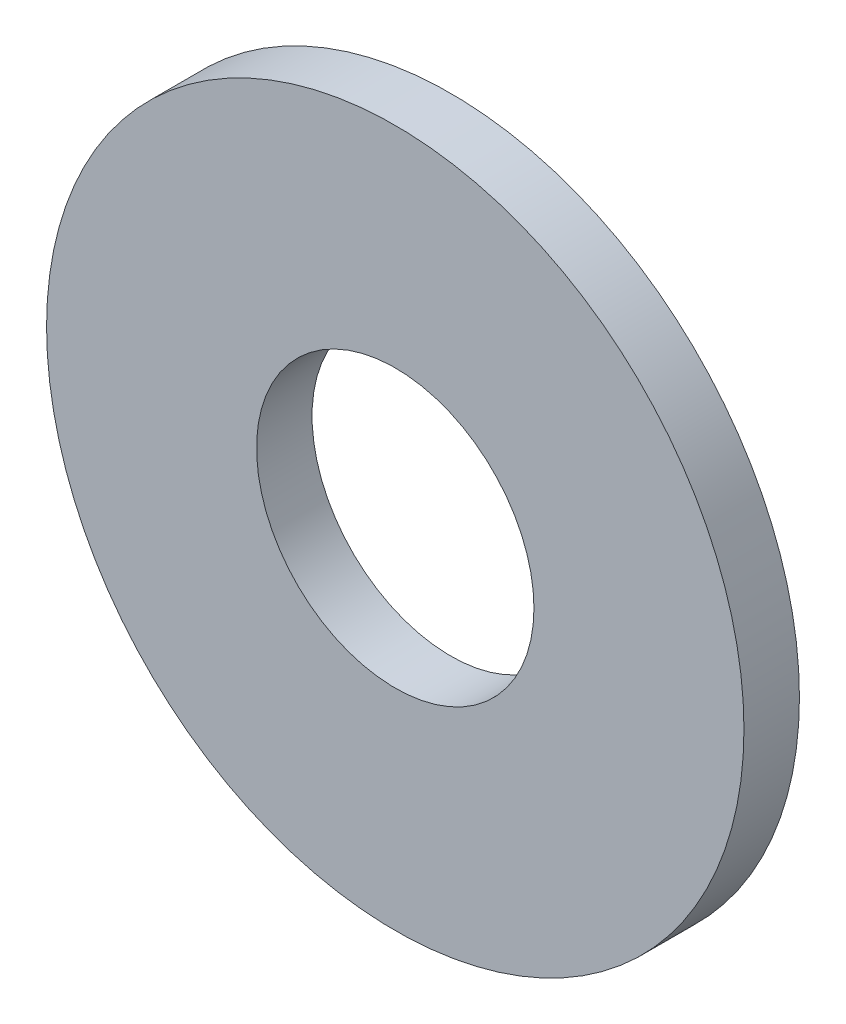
from build123d import *

# Parameters (mm, degrees)
ESQUISSE1_R      = 4.4
ESQUISSE1_R_2    = 1.75
EXTRUSION1_DEPTH = 0.7


with BuildPart() as part:
    # Esquisse1 → Extrusion1 (new body)
    with BuildSketch(Plane.XY):
        Circle(ESQUISSE1_R)
        Circle(ESQUISSE1_R_2, mode=Mode.SUBTRACT)
    extrude(amount=EXTRUSION1_DEPTH)


solid = part.part
